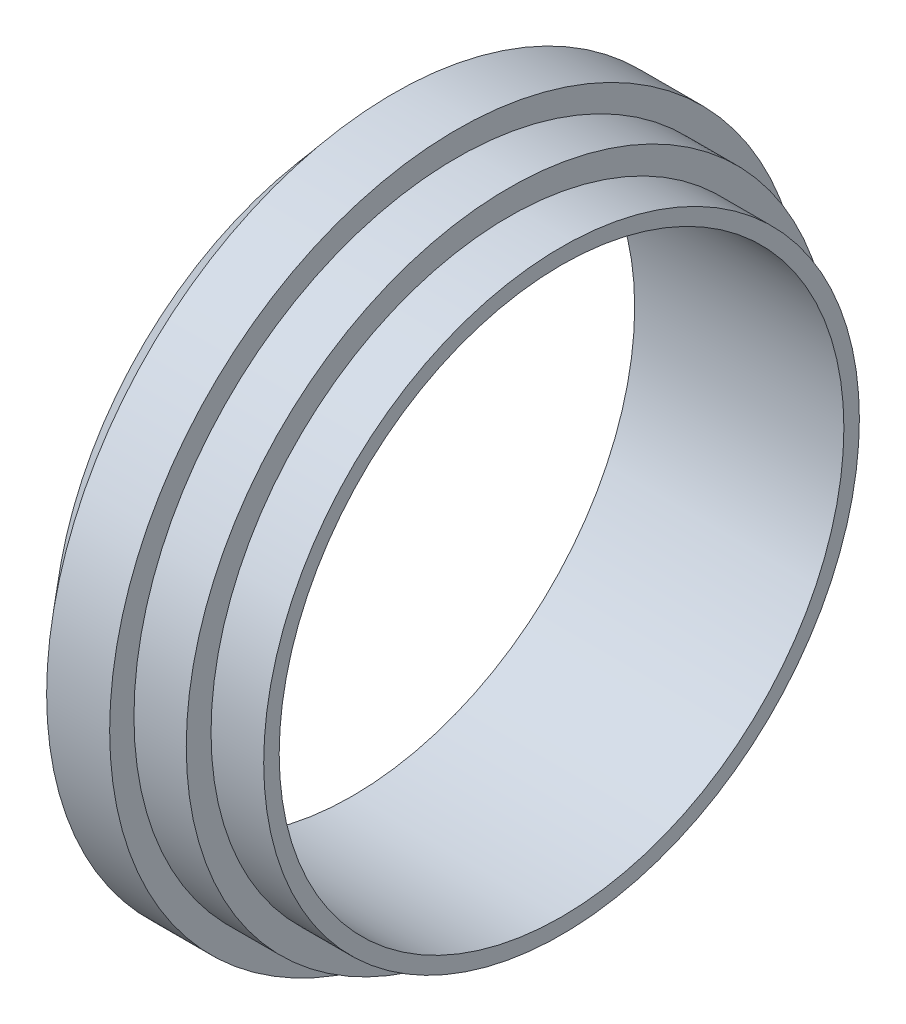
from build123d import *

# Parameters (mm, degrees)
SKETCH4_R          = 30.099
CUT_EXTRUDE1_DEPTH = 82.173790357


with BuildPart() as part:
    # Sketch1 → Revolve1 (revolve)
    with BuildSketch(Plane.XY, mode=Mode.PRIVATE) as revolve1_sk:
        Polygon((0, 0), (-5.6134, 0), (-5.6134, -2.6416), (-11.1887, -2.6416), (-11.1887, -5.2324), (-17.907, -5.2324), (-22.3012, -0.0762), (-22.3012, 31.75), (0, 31.75), align=None)
    revolve(revolve1_sk.sketch.rotate(Axis((-22.3012, 31.75, 0), (1, 0, 0)), 270), axis=Axis((-22.3012, 31.75, 0), (1, 0, 0)))

    # Sketch4 → Cut-Extrude1 (cut, through all)
    with BuildSketch(Plane.ZY.offset(22.3012)):
        with Locations((0, 31.75)):
            Circle(SKETCH4_R)
    extrude(amount=-CUT_EXTRUDE1_DEPTH, mode=Mode.SUBTRACT)


solid = part.part
